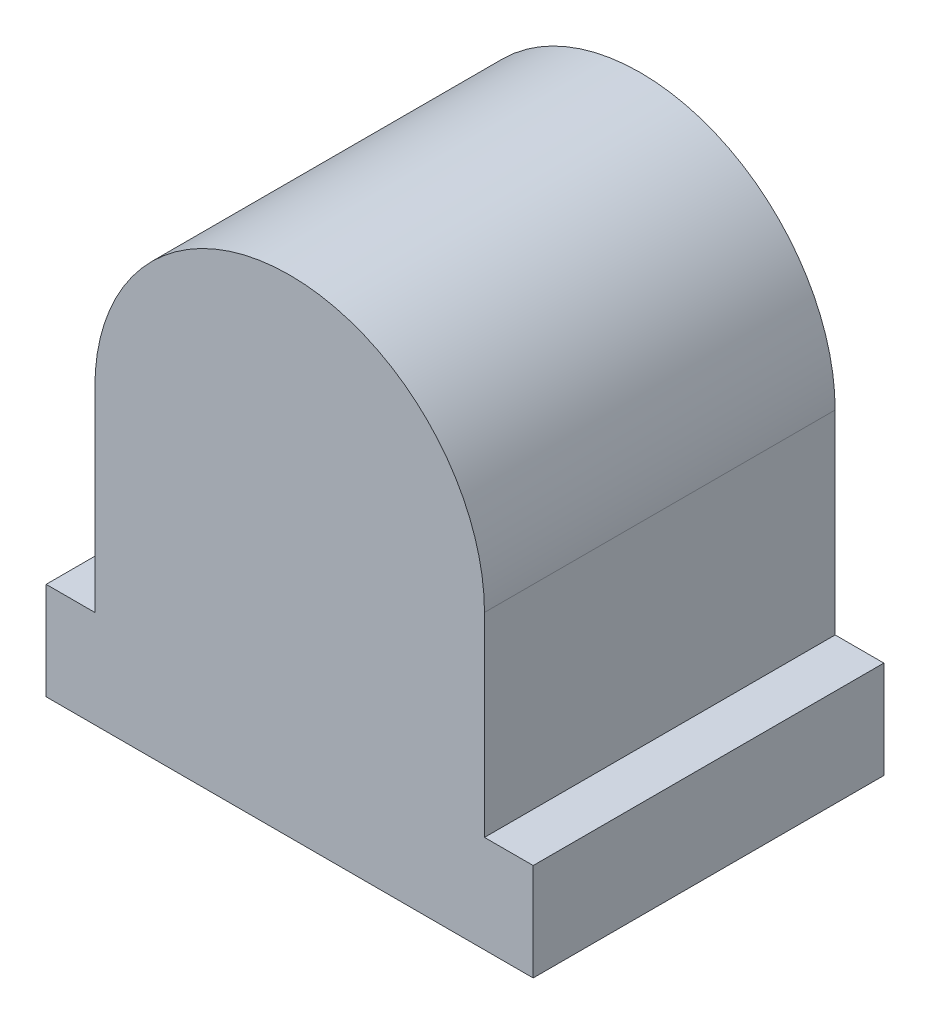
from build123d import *

# Parameters (mm, degrees)
EXTRUDE_1_DEPTH = 36


with BuildPart() as part:
    # Sketch 1 → Extrude 1 (new body)
    with BuildSketch(Plane.XY):
        with BuildLine():
            Line((-20, 16.190715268), (-20, -3.809284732))
            Line((-20, -3.809284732), (-25, -3.809284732))
            Line((-25, -3.809284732), (-25, -13.809284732))
            Line((-25, -13.809284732), (25, -13.809284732))
            Line((25, -13.809284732), (25, -3.809284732))
            Line((25, -3.809284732), (20, -3.809284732))
            Line((20, -3.809284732), (20, 16.190715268))
            ThreePointArc((20, 16.190715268), (0, 36.190715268), (-20, 16.190715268))
        make_face()
    extrude(amount=EXTRUDE_1_DEPTH)


solid = part.part
